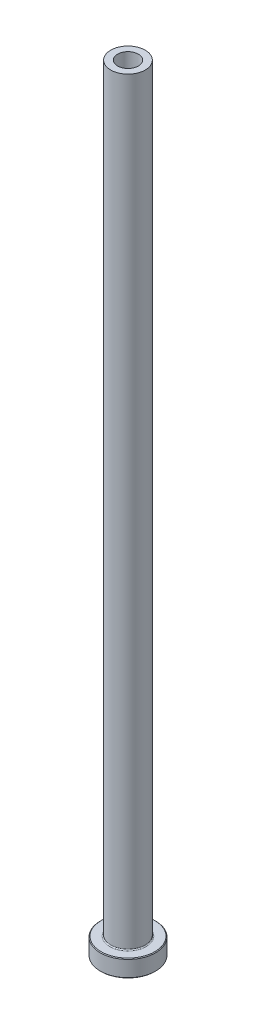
from build123d import *

# Parameters (mm, degrees)
FILLET1_R     = 0.3
CHAMFER1_SIZE = 0.2
CHAMFER3_SIZE = 0.5


with BuildPart() as part:
    # Sketch1 → Revolve1 (revolve)
    with BuildSketch(Plane.XY, mode=Mode.PRIVATE) as revolve1_sk:
        Polygon((-3, 225), (-5, 225), (-5, 5), (-8, 5), (-8, 0), (-3.25, 0), (-3.25, 168), (-3, 180), align=None)
    revolve(revolve1_sk.sketch.rotate(Axis((0, 92.187680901, 0), (0, -1, 0)), 270), axis=Axis((0, 92.187680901, 0), (0, -1, 0)))

    # Fillet1
    fillet1_edges = [part.edges().sort_by_distance(p)[0] for p in [
        (0, 5, -5),
    ]]
    fillet(fillet1_edges, radius=FILLET1_R)

    # Chamfer1
    chamfer1_edges = [part.edges().sort_by_distance(p)[0] for p in [
        (0, 0, -8),
        (0, 5, -8),
    ]]
    chamfer(chamfer1_edges, length=CHAMFER1_SIZE)

    # Chamfer3
    chamfer3_edges = [part.edges().sort_by_distance(p)[0] for p in [
        (0, 0, -3.25),
    ]]
    chamfer(chamfer3_edges, length=CHAMFER3_SIZE)


solid = part.part
